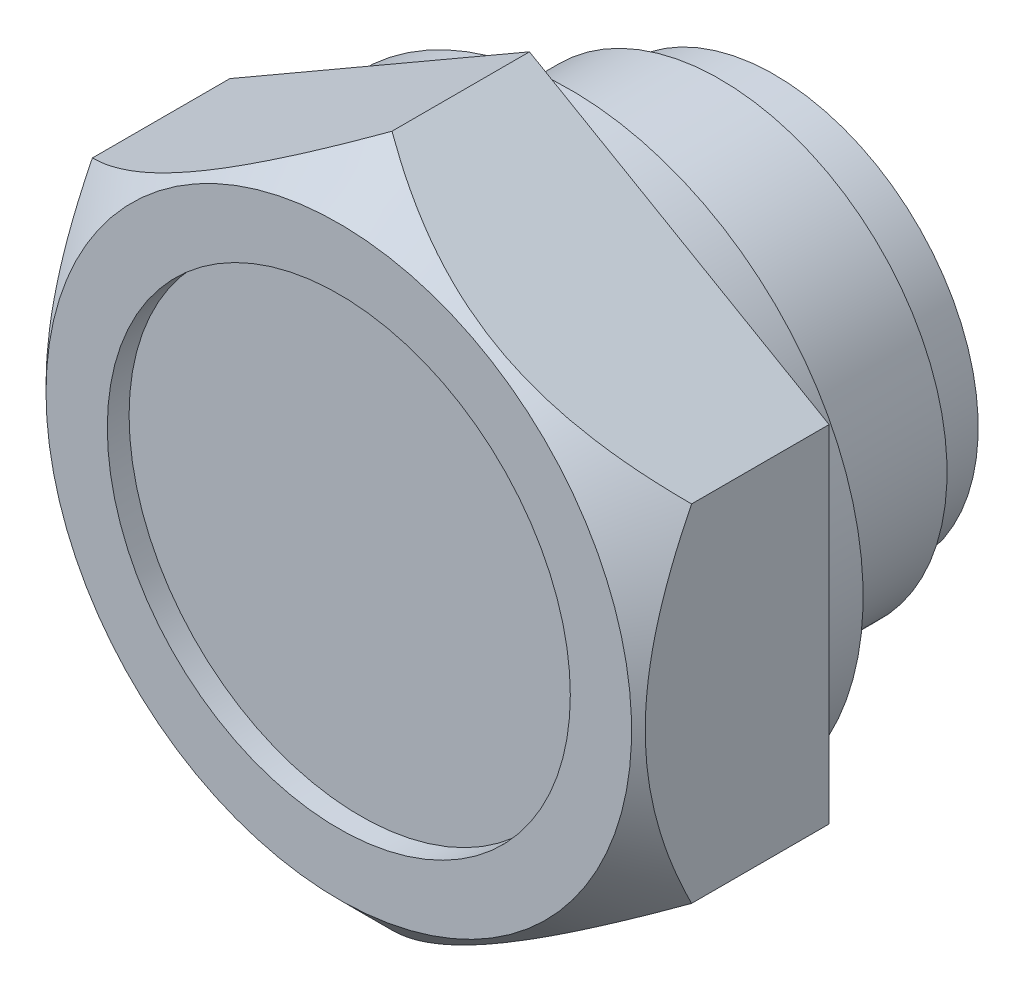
ISO-10303-21;
HEADER;
FILE_DESCRIPTION(('STEP AP214'),'2;1');
FILE_NAME('part.step','',(''),(''),'','','');
FILE_SCHEMA(('AUTOMOTIVE_DESIGN { 1 0 10303 214 1 1 1 1 }'));
ENDSEC;
DATA;
#1=APPLICATION_CONTEXT('core data for automotive mechanical design processes');
#2=APPLICATION_PROTOCOL_DEFINITION('international standard','automotive_design',2000,#1);
#3=PRODUCT_CONTEXT('',#1,'mechanical');
#4=PRODUCT('Part','Part','',(#3));
#5=PRODUCT_RELATED_PRODUCT_CATEGORY('part','',(#4));
#6=PRODUCT_DEFINITION_FORMATION('','',#4);
#7=PRODUCT_DEFINITION_CONTEXT('part definition',#1,'design');
#8=PRODUCT_DEFINITION('design','',#6,#7);
#9=PRODUCT_DEFINITION_SHAPE('','',#8);
#10=(LENGTH_UNIT() NAMED_UNIT(*) SI_UNIT(.MILLI.,.METRE.));
#11=(NAMED_UNIT(*) PLANE_ANGLE_UNIT() SI_UNIT($,.RADIAN.));
#12=(NAMED_UNIT(*) SI_UNIT($,.STERADIAN.) SOLID_ANGLE_UNIT());
#13=UNCERTAINTY_MEASURE_WITH_UNIT(LENGTH_MEASURE(1.E-05),#10,'distance_accuracy_value','');
#14=(GEOMETRIC_REPRESENTATION_CONTEXT(3) GLOBAL_UNCERTAINTY_ASSIGNED_CONTEXT((#13)) GLOBAL_UNIT_ASSIGNED_CONTEXT((#10,
#11,#12)) REPRESENTATION_CONTEXT('',''));
#15=CARTESIAN_POINT('',(0.,0.,0.));
#16=DIRECTION('',(0.,0.,1.));
#17=DIRECTION('',(1.,0.,0.));
#18=AXIS2_PLACEMENT_3D('',#15,#16,#17);
#19=CARTESIAN_POINT('',(0.,10.75,1.5));
#20=DIRECTION('',(0.,0.,-1.));
#21=DIRECTION('',(-1.,0.,0.));
#22=AXIS2_PLACEMENT_3D('',#19,#20,#21);
#23=PLANE('',#22);
#24=CARTESIAN_POINT('',(0.,0.,1.5));
#25=DIRECTION('',(0.,0.,-1.));
#26=DIRECTION('',(-1.,0.,0.));
#27=AXIS2_PLACEMENT_3D('',#24,#25,#26);
#28=CIRCLE('',#27,10.75);
#29=CARTESIAN_POINT('',(-10.75,0.,1.5));
#30=VERTEX_POINT('',#29);
#31=EDGE_CURVE('E127',#30,#30,#28,.T.);
#32=ORIENTED_EDGE('',*,*,#31,.F.);
#33=EDGE_LOOP('',(#32));
#34=FACE_BOUND('',#33,.T.);
#35=DIRECTION('',(-0.866025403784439,-0.5,0.));
#36=VECTOR('',#35,1.);
#37=CARTESIAN_POINT('',(-0.845113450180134,12.2137794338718,1.5));
#38=LINE('',#37,#36);
#39=CARTESIAN_POINT('',(-1.61363977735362E-11,12.7017059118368,1.5));
#40=VERTEX_POINT('',#39);
#41=CARTESIAN_POINT('',(-10.9999999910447,6.35085295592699,1.5));
#42=VERTEX_POINT('',#41);
#43=EDGE_CURVE('E110',#40,#42,#38,.T.);
#44=ORIENTED_EDGE('',*,*,#43,.F.);
#45=DIRECTION('',(-0.866025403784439,0.5,0.));
#46=VECTOR('',#45,1.);
#47=CARTESIAN_POINT('',(0.84511345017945,12.2137794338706,1.5));
#48=LINE('',#47,#46);
#49=CARTESIAN_POINT('',(10.9999999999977,6.35085294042,1.5));
#50=VERTEX_POINT('',#49);
#51=EDGE_CURVE('E107',#50,#40,#48,.T.);
#52=ORIENTED_EDGE('',*,*,#51,.F.);
#53=DIRECTION('',(7.05455251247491E-10,1.,0.));
#54=VECTOR('',#53,1.);
#55=CARTESIAN_POINT('',(11.0000000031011,10.74999999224,1.5));
#56=LINE('',#55,#54);
#57=CARTESIAN_POINT('',(10.9999999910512,-6.35085295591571,1.5));
#58=VERTEX_POINT('',#57);
#59=EDGE_CURVE('E40',#58,#50,#56,.T.);
#60=ORIENTED_EDGE('',*,*,#59,.F.);
#61=DIRECTION('',(0.866025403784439,0.5,0.));
#62=VECTOR('',#61,1.);
#63=CARTESIAN_POINT('',(10.1548865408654,-6.83877943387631,1.5));
#64=LINE('',#63,#62);
#65=CARTESIAN_POINT('',(5.77055764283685E-12,-12.7017059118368,1.5));
#66=VERTEX_POINT('',#65);
#67=EDGE_CURVE('E35',#66,#58,#64,.T.);
#68=ORIENTED_EDGE('',*,*,#67,.F.);
#69=DIRECTION('',(0.866025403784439,-0.5,0.));
#70=VECTOR('',#69,1.);
#71=CARTESIAN_POINT('',(-10.1548865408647,-6.83877943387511,1.5));
#72=LINE('',#71,#70);
#73=CARTESIAN_POINT('',(-10.9999999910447,-6.3508529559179,1.5));
#74=VERTEX_POINT('',#73);
#75=EDGE_CURVE('E68',#74,#66,#72,.T.);
#76=ORIENTED_EDGE('',*,*,#75,.F.);
#77=DIRECTION('',(0.,-1.,0.));
#78=VECTOR('',#77,1.);
#79=CARTESIAN_POINT('',(-10.9999999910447,10.75,1.5));
#80=LINE('',#79,#78);
#81=EDGE_CURVE('E70',#42,#74,#80,.T.);
#82=ORIENTED_EDGE('',*,*,#81,.F.);
#83=EDGE_LOOP('',(#44,#52,#60,#68,#76,#82));
#84=FACE_BOUND('',#83,.T.);
#85=ADVANCED_FACE('F14',(#34,#84),#23,.T.);
#86=CARTESIAN_POINT('',(0.,8.331,0.));
#87=DIRECTION('',(0.,0.,-1.));
#88=DIRECTION('',(-1.,0.,0.));
#89=AXIS2_PLACEMENT_3D('',#86,#87,#88);
#90=PLANE('',#89);
#91=CARTESIAN_POINT('',(0.,0.,0.));
#92=DIRECTION('',(0.,0.,-1.));
#93=DIRECTION('',(-1.,0.,0.));
#94=AXIS2_PLACEMENT_3D('',#91,#92,#93);
#95=CIRCLE('',#94,10.75);
#96=CARTESIAN_POINT('',(-10.75,0.,0.));
#97=VERTEX_POINT('',#96);
#98=EDGE_CURVE('E130',#97,#97,#95,.T.);
#99=ORIENTED_EDGE('',*,*,#98,.T.);
#100=EDGE_LOOP('',(#99));
#101=FACE_BOUND('',#100,.T.);
#102=CARTESIAN_POINT('',(0.,0.,0.));
#103=DIRECTION('',(0.,0.,-1.));
#104=DIRECTION('',(-1.,0.,0.));
#105=AXIS2_PLACEMENT_3D('',#102,#103,#104);
#106=CIRCLE('',#105,8.331);
#107=CARTESIAN_POINT('',(-8.331,0.,0.));
#108=VERTEX_POINT('',#107);
#109=EDGE_CURVE('E112',#108,#108,#106,.T.);
#110=ORIENTED_EDGE('',*,*,#109,.F.);
#111=EDGE_LOOP('',(#110));
#112=FACE_BOUND('',#111,.T.);
#113=ADVANCED_FACE('F16',(#101,#112),#90,.T.);
#114=CARTESIAN_POINT('',(0.,0.,-11.2427603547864));
#115=DIRECTION('',(0.,0.,-1.));
#116=DIRECTION('',(-1.,0.,0.));
#117=AXIS2_PLACEMENT_3D('',#114,#115,#116);
#118=CYLINDRICAL_SURFACE('',#117,10.75);
#119=ORIENTED_EDGE('',*,*,#31,.T.);
#120=EDGE_LOOP('',(#119));
#121=FACE_BOUND('',#120,.T.);
#122=ORIENTED_EDGE('',*,*,#98,.F.);
#123=EDGE_LOOP('',(#122));
#124=FACE_BOUND('',#123,.T.);
#125=ADVANCED_FACE('F201',(#121,#124),#118,.T.);
#126=CARTESIAN_POINT('',(0.,0.,-7.5));
#127=DIRECTION('',(0.,0.,-1.));
#128=DIRECTION('',(-1.,0.,0.));
#129=AXIS2_PLACEMENT_3D('',#126,#127,#128);
#130=PLANE('',#129);
#131=CARTESIAN_POINT('',(0.,0.,-7.5));
#132=DIRECTION('',(0.,0.,-1.));
#133=DIRECTION('',(-1.,0.,0.));
#134=AXIS2_PLACEMENT_3D('',#131,#132,#133);
#135=CIRCLE('',#134,7.475);
#136=CARTESIAN_POINT('',(-7.475,0.,-7.5));
#137=VERTEX_POINT('',#136);
#138=EDGE_CURVE('E121',#137,#137,#135,.T.);
#139=ORIENTED_EDGE('',*,*,#138,.T.);
#140=EDGE_LOOP('',(#139));
#141=FACE_BOUND('',#140,.T.);
#142=ADVANCED_FACE('F198',(#141),#130,.T.);
#143=CARTESIAN_POINT('',(0.,0.,-11.2427603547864));
#144=DIRECTION('',(0.,0.,-1.));
#145=DIRECTION('',(-1.,0.,0.));
#146=AXIS2_PLACEMENT_3D('',#143,#144,#145);
#147=CYLINDRICAL_SURFACE('',#146,7.475);
#148=ORIENTED_EDGE('',*,*,#138,.F.);
#149=EDGE_LOOP('',(#148));
#150=FACE_BOUND('',#149,.T.);
#151=CARTESIAN_POINT('',(0.,0.,-5.5));
#152=DIRECTION('',(0.,0.,-1.));
#153=DIRECTION('',(-1.,0.,0.));
#154=AXIS2_PLACEMENT_3D('',#151,#152,#153);
#155=CIRCLE('',#154,7.475);
#156=CARTESIAN_POINT('',(-7.475,0.,-5.5));
#157=VERTEX_POINT('',#156);
#158=EDGE_CURVE('E118',#157,#157,#155,.T.);
#159=ORIENTED_EDGE('',*,*,#158,.T.);
#160=EDGE_LOOP('',(#159));
#161=FACE_BOUND('',#160,.T.);
#162=ADVANCED_FACE('F195',(#150,#161),#147,.T.);
#163=CARTESIAN_POINT('',(0.,7.475,-5.5));
#164=DIRECTION('',(0.,0.,-1.));
#165=DIRECTION('',(-1.,0.,0.));
#166=AXIS2_PLACEMENT_3D('',#163,#164,#165);
#167=PLANE('',#166);
#168=CARTESIAN_POINT('',(0.,0.,-5.5));
#169=DIRECTION('',(0.,0.,-1.));
#170=DIRECTION('',(-1.,0.,0.));
#171=AXIS2_PLACEMENT_3D('',#168,#169,#170);
#172=CIRCLE('',#171,8.331);
#173=CARTESIAN_POINT('',(-8.331,0.,-5.5));
#174=VERTEX_POINT('',#173);
#175=EDGE_CURVE('E115',#174,#174,#172,.T.);
#176=ORIENTED_EDGE('',*,*,#175,.T.);
#177=EDGE_LOOP('',(#176));
#178=FACE_BOUND('',#177,.T.);
#179=ORIENTED_EDGE('',*,*,#158,.F.);
#180=EDGE_LOOP('',(#179));
#181=FACE_BOUND('',#180,.T.);
#182=ADVANCED_FACE('F191',(#178,#181),#167,.T.);
#183=CARTESIAN_POINT('',(0.,0.,-11.2427603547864));
#184=DIRECTION('',(0.,0.,-1.));
#185=DIRECTION('',(-1.,0.,0.));
#186=AXIS2_PLACEMENT_3D('',#183,#184,#185);
#187=CYLINDRICAL_SURFACE('',#186,8.331);
#188=ORIENTED_EDGE('',*,*,#175,.F.);
#189=EDGE_LOOP('',(#188));
#190=FACE_BOUND('',#189,.T.);
#191=ORIENTED_EDGE('',*,*,#109,.T.);
#192=EDGE_LOOP('',(#191));
#193=FACE_BOUND('',#192,.T.);
#194=ADVANCED_FACE('F188',(#190,#193),#187,.T.);
#195=CARTESIAN_POINT('',(-10.9999999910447,6.35085295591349,-7.5));
#196=DIRECTION('',(0.5,-0.866025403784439,0.));
#197=DIRECTION('',(-0.866025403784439,-0.5,0.));
#198=AXIS2_PLACEMENT_3D('',#195,#196,#197);
#199=PLANE('',#198);
#200=DIRECTION('',(0.,0.,1.));
#201=VECTOR('',#200,1.);
#202=CARTESIAN_POINT('',(-1.36696209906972E-12,12.7017059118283,-7.5));
#203=LINE('',#202,#201);
#204=CARTESIAN_POINT('',(-1.36696209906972E-12,12.7017059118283,6.5482940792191));
#205=VERTEX_POINT('',#204);
#206=EDGE_CURVE('E84',#40,#205,#203,.T.);
#207=ORIENTED_EDGE('',*,*,#206,.F.);
#208=ORIENTED_EDGE('',*,*,#43,.T.);
#209=DIRECTION('',(0.,0.,1.));
#210=VECTOR('',#209,1.);
#211=CARTESIAN_POINT('',(-10.9999999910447,6.35085295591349,-7.5));
#212=LINE('',#211,#210);
#213=CARTESIAN_POINT('',(-10.9999999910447,6.35085295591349,6.54829407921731));
#214=VERTEX_POINT('',#213);
#215=EDGE_CURVE('E83',#42,#214,#212,.T.);
#216=ORIENTED_EDGE('',*,*,#215,.T.);
#217=CARTESIAN_POINT('',(0.000199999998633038,12.7018213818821,6.5481786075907));
#218=CARTESIAN_POINT('',(-0.188914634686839,12.5926359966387,6.65734811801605));
#219=CARTESIAN_POINT('',(-0.379510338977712,12.48259551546,6.76318636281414));
#220=CARTESIAN_POINT('',(-0.763894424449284,12.2606712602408,6.96714214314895));
#221=CARTESIAN_POINT('',(-0.957684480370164,12.1487865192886,7.06525546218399));
#222=CARTESIAN_POINT('',(-1.34960183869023,11.9225129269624,7.25311872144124));
#223=CARTESIAN_POINT('',(-1.54774762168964,11.8081134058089,7.34281755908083));
#224=CARTESIAN_POINT('',(-1.94729364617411,11.5774354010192,7.51190368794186));
#225=CARTESIAN_POINT('',(-2.14869338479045,11.4611572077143,7.59129255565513));
#226=CARTESIAN_POINT('',(-2.55150915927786,11.2285914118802,7.73724688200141));
#227=CARTESIAN_POINT('',(-2.75287569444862,11.1123323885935,7.80399344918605));
#228=CARTESIAN_POINT('',(-3.15843154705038,10.8781846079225,7.9248319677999));
#229=CARTESIAN_POINT('',(-3.36262055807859,10.7602960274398,7.9789252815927));
#230=CARTESIAN_POINT('',(-3.77294799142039,10.523393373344,8.07309544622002));
#231=CARTESIAN_POINT('',(-3.9790809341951,10.4043824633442,8.1132038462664));
#232=CARTESIAN_POINT('',(-4.39307735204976,10.1653615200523,8.17852285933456));
#233=CARTESIAN_POINT('',(-4.60094056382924,10.0453516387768,8.20373569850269));
#234=CARTESIAN_POINT('',(-5.10748652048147,9.75289719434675,8.24601057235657));
#235=CARTESIAN_POINT('',(-5.406716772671,9.58013652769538,8.2548818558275));
#236=CARTESIAN_POINT('',(-6.00463608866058,9.23492764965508,8.23999113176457));
#237=CARTESIAN_POINT('',(-6.30332492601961,9.06247956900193,8.21621768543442));
#238=CARTESIAN_POINT('',(-6.89788699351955,8.7192089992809,8.13744074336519));
#239=CARTESIAN_POINT('',(-7.19375669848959,8.54838854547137,8.08240232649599));
#240=CARTESIAN_POINT('',(-7.78041067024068,8.20968371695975,7.94408715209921));
#241=CARTESIAN_POINT('',(-8.07119532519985,8.04179911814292,7.86081256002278));
#242=CARTESIAN_POINT('',(-8.58737457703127,7.74378288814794,7.68949668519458));
#243=CARTESIAN_POINT('',(-8.8139124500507,7.61299118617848,7.60596208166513));
#244=CARTESIAN_POINT('',(-9.26292184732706,7.35375548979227,7.4254323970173));
#245=CARTESIAN_POINT('',(-9.48539324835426,7.22531156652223,7.32843690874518));
#246=CARTESIAN_POINT('',(-9.92556897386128,6.97117599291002,7.12315952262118));
#247=CARTESIAN_POINT('',(-10.1432858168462,6.84547711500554,7.01491311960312));
#248=CARTESIAN_POINT('',(-10.5746882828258,6.5964067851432,6.78855485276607));
#249=CARTESIAN_POINT('',(-10.7883762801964,6.47303396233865,6.67044903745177));
#250=CARTESIAN_POINT('',(-11.0001999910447,6.3507374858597,6.5481786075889));
#251=B_SPLINE_CURVE_WITH_KNOTS('',3,(#217,#218,#219,#220,#221,#222,#223,#224,#225,#226,#227,
#228,#229,#230,#231,#232,#233,#234,#235,#236,#237,#238,#239,#240,#241,#242,#243,#244,#245,#246,
#247,#248,#249,#250),.UNSPECIFIED.,.F.,.F.,(4,2,2,2,2,2,2,2,2,2,2,2,2,2,2,2,4),(0.,
0.732447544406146,1.46529214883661,2.20233279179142,2.93926060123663,3.66466501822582,
4.3899912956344,5.11367052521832,5.83724157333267,6.87253110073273,7.90818348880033,
8.94499492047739,9.98172685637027,10.8051335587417,11.628565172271,12.4494736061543,
13.2698820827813),.UNSPECIFIED.);
#252=EDGE_CURVE('E9',#205,#214,#251,.T.);
#253=ORIENTED_EDGE('',*,*,#252,.F.);
#254=EDGE_LOOP('',(#207,#208,#216,#253));
#255=FACE_BOUND('',#254,.T.);
#256=ADVANCED_FACE('F185',(#255),#199,.F.);
#257=CARTESIAN_POINT('',(-1.36696209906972E-12,12.7017059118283,-7.5));
#258=DIRECTION('',(-0.5,-0.866025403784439,0.));
#259=DIRECTION('',(-0.866025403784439,0.5,0.));
#260=AXIS2_PLACEMENT_3D('',#257,#258,#259);
#261=PLANE('',#260);
#262=DIRECTION('',(0.,0.,1.));
#263=VECTOR('',#262,1.);
#264=CARTESIAN_POINT('',(10.9999999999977,6.35085295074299,-7.5));
#265=LINE('',#264,#263);
#266=CARTESIAN_POINT('',(10.9999999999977,6.35085295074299,6.54829407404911));
#267=VERTEX_POINT('',#266);
#268=EDGE_CURVE('E100',#50,#267,#265,.T.);
#269=ORIENTED_EDGE('',*,*,#268,.F.);
#270=ORIENTED_EDGE('',*,*,#51,.T.);
#271=ORIENTED_EDGE('',*,*,#206,.T.);
#272=CARTESIAN_POINT('',(11.0001999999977,6.3507374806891,6.5481786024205));
#273=CARTESIAN_POINT('',(10.811085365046,6.45992286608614,6.65734811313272));
#274=CARTESIAN_POINT('',(10.6204896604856,6.56996334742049,6.76318635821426));
#275=CARTESIAN_POINT('',(10.2361055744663,6.79188760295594,6.96714213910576));
#276=CARTESIAN_POINT('',(10.0423155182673,6.90377234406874,7.06525545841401));
#277=CARTESIAN_POINT('',(9.65039815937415,7.13004593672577,7.25311871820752));
#278=CARTESIAN_POINT('',(9.45225237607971,7.24444545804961,7.34281755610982));
#279=CARTESIAN_POINT('',(9.05270635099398,7.47512346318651,7.51190368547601));
#280=CARTESIAN_POINT('',(8.85130661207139,7.59140165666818,7.59129255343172));
#281=CARTESIAN_POINT('',(8.44849083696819,7.82396745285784,7.73724688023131));
#282=CARTESIAN_POINT('',(8.24712430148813,7.94022647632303,7.80399344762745));
#283=CARTESIAN_POINT('',(7.84156844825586,8.17437425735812,7.92483196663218));
#284=CARTESIAN_POINT('',(7.63737943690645,8.29226283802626,7.97892528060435));
#285=CARTESIAN_POINT('',(7.22705200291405,8.52916549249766,8.07309544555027));
#286=CARTESIAN_POINT('',(7.02091905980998,8.64817640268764,8.11320384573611));
#287=CARTESIAN_POINT('',(6.60692264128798,8.88719734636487,8.17852285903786));
#288=CARTESIAN_POINT('',(6.39905942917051,9.00720722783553,8.20373569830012));
#289=CARTESIAN_POINT('',(5.89251347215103,9.29966167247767,8.2460105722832));
#290=CARTESIAN_POINT('',(5.59328321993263,9.4724223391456,8.25488185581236));
#291=CARTESIAN_POINT('',(4.99536390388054,9.81763121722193,8.23999113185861));
#292=CARTESIAN_POINT('',(4.69667506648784,9.99007929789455,8.21621768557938));
#293=CARTESIAN_POINT('',(4.10211299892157,10.3333498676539,8.13744074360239));
#294=CARTESIAN_POINT('',(3.80624329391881,10.5041703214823,8.08240232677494));
#295=CARTESIAN_POINT('',(3.21958932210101,10.8428751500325,7.94408715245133));
#296=CARTESIAN_POINT('',(2.92880466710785,11.010759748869,7.86081256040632));
#297=CARTESIAN_POINT('',(2.41262541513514,11.3087759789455,7.68949668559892));
#298=CARTESIAN_POINT('',(2.18608754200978,11.4395676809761,7.60596208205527));
#299=CARTESIAN_POINT('',(1.73707814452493,11.6988033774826,7.42543239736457));
#300=CARTESIAN_POINT('',(1.51460674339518,11.8272473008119,7.32843690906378));
#301=CARTESIAN_POINT('',(1.07443101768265,12.0813828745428,7.1231595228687));
#302=CARTESIAN_POINT('',(0.856714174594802,12.2070817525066,7.01491311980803));
#303=CARTESIAN_POINT('',(0.425311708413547,12.4561520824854,6.7885548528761));
#304=CARTESIAN_POINT('',(0.211623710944,12.5795249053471,6.67044903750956));
#305=CARTESIAN_POINT('',(-0.000200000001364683,12.7018213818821,6.5481786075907));
#306=B_SPLINE_CURVE_WITH_KNOTS('',3,(#272,#273,#274,#275,#276,#277,#278,#279,#280,#281,#282,
#283,#284,#285,#286,#287,#288,#289,#290,#291,#292,#293,#294,#295,#296,#297,#298,#299,#300,#301,
#302,#303,#304,#305),.UNSPECIFIED.,.F.,.F.,(4,2,2,2,2,2,2,2,2,2,2,2,2,2,2,2,4),(0.,
0.732447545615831,1.46529215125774,2.20233279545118,2.93926060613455,3.66466502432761,
4.38999130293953,5.1136705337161,5.83724158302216,6.87253111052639,7.90818349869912,
8.94499493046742,9.98172686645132,10.8051335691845,11.628565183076,12.4494736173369,
13.2698820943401),.UNSPECIFIED.);
#307=EDGE_CURVE('E28',#267,#205,#306,.T.);
#308=ORIENTED_EDGE('',*,*,#307,.F.);
#309=EDGE_LOOP('',(#269,#270,#271,#308));
#310=FACE_BOUND('',#309,.T.);
#311=ADVANCED_FACE('F180',(#310),#261,.F.);
#312=CARTESIAN_POINT('',(10.9999999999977,6.35085295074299,-7.5));
#313=DIRECTION('',(-1.,7.05455251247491E-10,0.));
#314=DIRECTION('',(7.05455251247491E-10,1.,0.));
#315=AXIS2_PLACEMENT_3D('',#312,#313,#314);
#316=PLANE('',#315);
#317=DIRECTION('',(0.,0.,1.));
#318=VECTOR('',#317,1.);
#319=CARTESIAN_POINT('',(10.9999999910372,-6.3508529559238,-7.5));
#320=LINE('',#319,#318);
#321=CARTESIAN_POINT('',(10.9999999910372,-6.3508529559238,6.54829407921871));
#322=VERTEX_POINT('',#321);
#323=EDGE_CURVE('E92',#58,#322,#320,.T.);
#324=ORIENTED_EDGE('',*,*,#323,.F.);
#325=ORIENTED_EDGE('',*,*,#59,.T.);
#326=ORIENTED_EDGE('',*,*,#268,.T.);
#327=CARTESIAN_POINT('',(10.9999999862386,-13.1530028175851,2.1035285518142));
#328=CARTESIAN_POINT('',(10.999999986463,-12.8348404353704,2.34753495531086));
#329=CARTESIAN_POINT('',(10.9999999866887,-12.5149523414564,2.58932675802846));
#330=CARTESIAN_POINT('',(10.9999999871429,-11.8710234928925,3.06747277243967));
#331=CARTESIAN_POINT('',(10.9999999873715,-11.546981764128,3.30382567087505));
#332=CARTESIAN_POINT('',(10.9999999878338,-10.8916753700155,3.77176769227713));
#333=CARTESIAN_POINT('',(10.9999999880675,-10.5603742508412,4.00330593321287));
#334=CARTESIAN_POINT('',(10.9999999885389,-9.8922387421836,4.45822908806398));
#335=CARTESIAN_POINT('',(10.9999999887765,-9.55540473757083,4.68161456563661));
#336=CARTESIAN_POINT('',(10.9999999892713,-8.85408498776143,5.13199419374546));
#337=CARTESIAN_POINT('',(10.9999999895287,-8.48918429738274,5.35834545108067));
#338=CARTESIAN_POINT('',(10.9999999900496,-7.75082072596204,5.79686046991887));
#339=CARTESIAN_POINT('',(10.999999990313,-7.37735643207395,6.00902186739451));
#340=CARTESIAN_POINT('',(10.999999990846,-6.6217866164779,6.41462859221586));
#341=CARTESIAN_POINT('',(10.9999999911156,-6.23971083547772,6.60812888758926));
#342=CARTESIAN_POINT('',(10.9999999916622,-5.46482097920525,6.97207847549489));
#343=CARTESIAN_POINT('',(10.9999999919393,-5.07201204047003,7.14253856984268));
#344=CARTESIAN_POINT('',(10.9999999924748,-4.31299594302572,7.43932768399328));
#345=CARTESIAN_POINT('',(10.9999999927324,-3.9478404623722,7.56831887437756));
#346=CARTESIAN_POINT('',(10.9999999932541,-3.20831241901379,7.79706368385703));
#347=CARTESIAN_POINT('',(10.9999999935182,-2.83393926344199,7.89681541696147));
#348=CARTESIAN_POINT('',(10.9999999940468,-2.08468080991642,8.0600532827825));
#349=CARTESIAN_POINT('',(10.9999999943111,-1.7099400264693,8.12419164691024));
#350=CARTESIAN_POINT('',(10.9999999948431,-0.955912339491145,8.21487946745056));
#351=CARTESIAN_POINT('',(10.9999999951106,-0.576626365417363,8.24143648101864));
#352=CARTESIAN_POINT('',(10.9999999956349,0.166570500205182,8.25474812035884));
#353=CARTESIAN_POINT('',(10.9999999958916,0.530452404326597,8.2431404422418));
#354=CARTESIAN_POINT('',(10.999999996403,1.25533124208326,8.18450074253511));
#355=CARTESIAN_POINT('',(10.9999999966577,1.61632790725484,8.13746546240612));
#356=CARTESIAN_POINT('',(10.9999999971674,2.33893839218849,8.00981463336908));
#357=CARTESIAN_POINT('',(10.9999999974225,2.70044637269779,7.92860991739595));
#358=CARTESIAN_POINT('',(10.9999999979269,3.41551710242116,7.73709548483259));
#359=CARTESIAN_POINT('',(10.9999999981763,3.76908033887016,7.62678755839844));
#360=CARTESIAN_POINT('',(10.9999999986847,4.48973486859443,7.3741148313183));
#361=CARTESIAN_POINT('',(10.9999999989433,4.85626279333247,7.23016108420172));
#362=CARTESIAN_POINT('',(10.9999999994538,5.57987775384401,6.92003336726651));
#363=CARTESIAN_POINT('',(10.9999999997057,5.93696042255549,6.75384932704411));
#364=CARTESIAN_POINT('',(11.000000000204,6.64337989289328,6.40320367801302));
#365=CARTESIAN_POINT('',(11.0000000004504,6.99268843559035,6.21868559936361));
#366=CARTESIAN_POINT('',(11.0000000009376,7.68329635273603,5.83543512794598));
#367=CARTESIAN_POINT('',(11.0000000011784,8.02459695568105,5.63670493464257));
#368=CARTESIAN_POINT('',(11.0000000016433,8.68354150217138,5.23791339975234));
#369=CARTESIAN_POINT('',(11.0000000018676,9.00152089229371,5.03840340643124));
#370=CARTESIAN_POINT('',(11.0000000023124,9.63201705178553,4.63090569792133));
#371=CARTESIAN_POINT('',(11.0000000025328,9.94453340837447,4.42291734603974));
#372=CARTESIAN_POINT('',(11.0000000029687,10.5623022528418,4.00167229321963));
#373=CARTESIAN_POINT('',(11.000000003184,10.8675929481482,3.78847142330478));
#374=CARTESIAN_POINT('',(11.0000000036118,11.473988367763,3.35636541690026));
#375=CARTESIAN_POINT('',(11.0000000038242,11.7750942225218,3.13746186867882));
#376=CARTESIAN_POINT('',(11.0000000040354,12.074445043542,2.91622445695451));
#377=B_SPLINE_CURVE_WITH_KNOTS('',3,(#327,#328,#329,#330,#331,#332,#333,#334,#335,#336,#337,
#338,#339,#340,#341,#342,#343,#344,#345,#346,#347,#348,#349,#350,#351,#352,#353,#354,#355,#356,
#357,#358,#359,#360,#361,#362,#363,#364,#365,#366,#367,#368,#369,#370,#371,#372,#373,#374,#375,
#376),.UNSPECIFIED.,.F.,.F.,(4,2,2,2,2,2,2,2,2,2,2,2,2,2,2,2,2,2,2,2,2,2,2,2,4),(0.,
1.20289302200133,2.40607350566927,3.61854532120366,4.83093315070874,6.11888725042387,
7.4070553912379,8.69130514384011,9.97495070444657,11.135753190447,12.2966305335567,
13.4354799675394,14.5741003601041,15.6645094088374,16.7550187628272,17.8651559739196,
18.9752249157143,20.1556679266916,21.3366475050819,22.5213844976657,23.7059385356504,
24.831940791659,25.9580277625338,27.0750572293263,28.1917788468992),.UNSPECIFIED.);
#378=EDGE_CURVE('E168',#322,#267,#377,.T.);
#379=ORIENTED_EDGE('',*,*,#378,.F.);
#380=EDGE_LOOP('',(#324,#325,#326,#379));
#381=FACE_BOUND('',#380,.T.);
#382=ADVANCED_FACE('F184',(#381),#316,.F.);
#383=CARTESIAN_POINT('',(10.9999999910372,-6.3508529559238,-7.5));
#384=DIRECTION('',(-0.5,0.866025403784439,0.));
#385=DIRECTION('',(0.866025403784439,0.5,0.));
#386=AXIS2_PLACEMENT_3D('',#383,#384,#385);
#387=PLANE('',#386);
#388=DIRECTION('',(0.,0.,1.));
#389=VECTOR('',#388,1.);
#390=CARTESIAN_POINT('',(1.346145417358E-12,-12.7017059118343,-7.5));
#391=LINE('',#390,#389);
#392=CARTESIAN_POINT('',(1.346145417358E-12,-12.7017059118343,6.5482940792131));
#393=VERTEX_POINT('',#392);
#394=EDGE_CURVE('E90',#66,#393,#391,.T.);
#395=ORIENTED_EDGE('',*,*,#394,.F.);
#396=ORIENTED_EDGE('',*,*,#67,.T.);
#397=ORIENTED_EDGE('',*,*,#323,.T.);
#398=CARTESIAN_POINT('',(-0.000199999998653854,-12.7018213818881,6.54817860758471));
#399=CARTESIAN_POINT('',(0.188914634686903,-12.5926359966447,6.65734811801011));
#400=CARTESIAN_POINT('',(0.379510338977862,-12.4825955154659,6.76318636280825));
#401=CARTESIAN_POINT('',(0.763894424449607,-12.2606712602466,6.96714214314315));
#402=CARTESIAN_POINT('',(0.957684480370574,-12.1487865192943,7.06525546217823));
#403=CARTESIAN_POINT('',(1.34960183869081,-11.9225129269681,7.25311872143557));
#404=CARTESIAN_POINT('',(1.54774762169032,-11.8081134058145,7.3428175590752));
#405=CARTESIAN_POINT('',(1.94729364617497,-11.5774354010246,7.51190368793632));
#406=CARTESIAN_POINT('',(2.14869338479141,-11.4611572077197,7.59129255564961));
#407=CARTESIAN_POINT('',(2.551509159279,-11.2285914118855,7.73724688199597));
#408=CARTESIAN_POINT('',(2.75287569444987,-11.1123323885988,7.80399344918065));
#409=CARTESIAN_POINT('',(3.15843154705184,-10.8781846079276,7.92483196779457));
#410=CARTESIAN_POINT('',(3.36262055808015,-10.7602960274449,7.97892528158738));
#411=CARTESIAN_POINT('',(3.77294799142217,-10.523393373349,8.07309544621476));
#412=CARTESIAN_POINT('',(3.97908093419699,-10.4043824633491,8.11320384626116));
#413=CARTESIAN_POINT('',(4.39307735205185,-10.165361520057,8.17852285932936));
#414=CARTESIAN_POINT('',(4.60094056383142,-10.0453516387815,8.20373569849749));
#415=CARTESIAN_POINT('',(5.10748652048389,-9.75289719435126,8.24601057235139));
#416=CARTESIAN_POINT('',(5.40671677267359,-9.58013652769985,8.25488185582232));
#417=CARTESIAN_POINT('',(6.00463608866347,-9.23492764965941,8.23999113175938));
#418=CARTESIAN_POINT('',(6.30332492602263,-9.06247956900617,8.21621768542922));
#419=CARTESIAN_POINT('',(6.89788699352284,-8.71920899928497,8.13744074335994));
#420=CARTESIAN_POINT('',(7.19375669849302,-8.54838854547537,8.08240232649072));
#421=CARTESIAN_POINT('',(7.78041067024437,-8.2096837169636,7.94408715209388));
#422=CARTESIAN_POINT('',(8.07119532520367,-8.0417991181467,7.86081256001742));
#423=CARTESIAN_POINT('',(8.58737457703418,-7.74378288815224,7.68949668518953));
#424=CARTESIAN_POINT('',(8.8139124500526,-7.61299118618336,7.60596208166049));
#425=CARTESIAN_POINT('',(9.26292184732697,-7.3537554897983,7.4254323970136));
#426=CARTESIAN_POINT('',(9.48539324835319,-7.22531156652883,7.32843690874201));
#427=CARTESIAN_POINT('',(9.92556897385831,-6.97117599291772,7.12315952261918));
#428=CARTESIAN_POINT('',(10.1432858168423,-6.84547711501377,7.01491311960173));
#429=CARTESIAN_POINT('',(10.57468828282,-6.59640678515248,6.78855485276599));
#430=CARTESIAN_POINT('',(10.7883762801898,-6.47303396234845,6.67044903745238));
#431=CARTESIAN_POINT('',(11.0001999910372,-6.35073748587,6.5481786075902));
#432=B_SPLINE_CURVE_WITH_KNOTS('',3,(#398,#399,#400,#401,#402,#403,#404,#405,#406,#407,#408,
#409,#410,#411,#412,#413,#414,#415,#416,#417,#418,#419,#420,#421,#422,#423,#424,#425,#426,#427,
#428,#429,#430,#431),.UNSPECIFIED.,.F.,.F.,(4,2,2,2,2,2,2,2,2,2,2,2,2,2,2,2,4),(0.,
0.732447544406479,1.46529214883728,2.20233279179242,2.93926060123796,3.66466501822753,
4.38999129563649,5.11367052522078,5.83724157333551,6.87253110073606,7.90818348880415,
8.94499492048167,9.981726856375,10.8051335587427,11.6285651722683,12.4494736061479,
13.2698820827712),.UNSPECIFIED.);
#433=EDGE_CURVE('E161',#393,#322,#432,.T.);
#434=ORIENTED_EDGE('',*,*,#433,.F.);
#435=EDGE_LOOP('',(#395,#396,#397,#434));
#436=FACE_BOUND('',#435,.T.);
#437=ADVANCED_FACE('F320',(#436),#387,.F.);
#438=CARTESIAN_POINT('',(1.346145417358E-12,-12.7017059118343,-7.5));
#439=DIRECTION('',(0.5,0.866025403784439,0.));
#440=DIRECTION('',(0.866025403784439,-0.5,0.));
#441=AXIS2_PLACEMENT_3D('',#438,#439,#440);
#442=PLANE('',#441);
#443=DIRECTION('',(0.,0.,1.));
#444=VECTOR('',#443,1.);
#445=CARTESIAN_POINT('',(-10.9999999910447,-6.3508529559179,-7.5));
#446=LINE('',#445,#444);
#447=CARTESIAN_POINT('',(-10.9999999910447,-6.350852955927,6.54829407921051));
#448=VERTEX_POINT('',#447);
#449=EDGE_CURVE('E80',#74,#448,#446,.T.);
#450=ORIENTED_EDGE('',*,*,#449,.F.);
#451=ORIENTED_EDGE('',*,*,#75,.T.);
#452=ORIENTED_EDGE('',*,*,#394,.T.);
#453=CARTESIAN_POINT('',(-11.0001999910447,-6.3507374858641,6.54817860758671));
#454=CARTESIAN_POINT('',(-10.8110853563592,-6.45992287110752,6.65734811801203));
#455=CARTESIAN_POINT('',(-10.6204896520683,-6.56996335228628,6.76318636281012));
#456=CARTESIAN_POINT('',(-10.2361055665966,-6.79188760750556,6.96714214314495));
#457=CARTESIAN_POINT('',(-10.0423155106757,-6.90377234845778,7.06525546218));
#458=CARTESIAN_POINT('',(-9.6503981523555,-7.13004594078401,7.25311872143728));
#459=CARTESIAN_POINT('',(-9.45225236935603,-7.24444546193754,7.34281755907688));
#460=CARTESIAN_POINT('',(-9.05270634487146,-7.47512346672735,7.51190368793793));
#461=CARTESIAN_POINT('',(-8.85130660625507,-7.59140166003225,7.59129255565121));
#462=CARTESIAN_POINT('',(-8.44849083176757,-7.82396745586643,7.7372468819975));
#463=CARTESIAN_POINT('',(-8.24712429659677,-7.94022647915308,7.80399344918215));
#464=CARTESIAN_POINT('',(-7.84156844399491,-8.17437425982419,7.92483196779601));
#465=CARTESIAN_POINT('',(-7.63737943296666,-8.29226284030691,7.97892528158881));
#466=CARTESIAN_POINT('',(-7.22705199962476,-8.52916549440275,8.07309544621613));
#467=CARTESIAN_POINT('',(-7.02091905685,-8.64817640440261,8.11320384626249));
#468=CARTESIAN_POINT('',(-6.60692263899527,-8.88719734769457,8.1785228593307));
#469=CARTESIAN_POINT('',(-6.39905942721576,-9.00720722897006,8.20373569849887));
#470=CARTESIAN_POINT('',(-5.8925134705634,-9.29966167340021,8.24601057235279));
#471=CARTESIAN_POINT('',(-5.59328321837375,-9.47242234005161,8.25488185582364));
#472=CARTESIAN_POINT('',(-4.99536390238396,-9.81763121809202,8.23999113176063));
#473=CARTESIAN_POINT('',(-4.69667506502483,-9.99007929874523,8.21621768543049));
#474=CARTESIAN_POINT('',(-4.10211299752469,-10.3333498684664,8.13744074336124));
#475=CARTESIAN_POINT('',(-3.80624329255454,-10.504170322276,8.08240232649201));
#476=CARTESIAN_POINT('',(-3.21958932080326,-10.8428751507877,7.94408715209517));
#477=CARTESIAN_POINT('',(-2.92880466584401,-11.0107597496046,7.8608125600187));
#478=CARTESIAN_POINT('',(-2.41262541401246,-11.3087759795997,7.68949668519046));
#479=CARTESIAN_POINT('',(-2.18608754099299,-11.4395676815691,7.605962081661));
#480=CARTESIAN_POINT('',(-1.73707814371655,-11.6988033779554,7.42543239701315));
#481=CARTESIAN_POINT('',(-1.51460674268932,-11.8272473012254,7.32843690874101));
#482=CARTESIAN_POINT('',(-1.07443101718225,-12.0813828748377,7.12315952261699));
#483=CARTESIAN_POINT('',(-0.856714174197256,-12.2070817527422,7.01491311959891));
#484=CARTESIAN_POINT('',(-0.425311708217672,-12.4561520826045,6.78855485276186));
#485=CARTESIAN_POINT('',(-0.211623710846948,-12.5795249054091,6.67044903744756));
#486=CARTESIAN_POINT('',(0.00020000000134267,-12.7018213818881,6.54817860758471));
#487=B_SPLINE_CURVE_WITH_KNOTS('',3,(#453,#454,#455,#456,#457,#458,#459,#460,#461,#462,#463,
#464,#465,#466,#467,#468,#469,#470,#471,#472,#473,#474,#475,#476,#477,#478,#479,#480,#481,#482,
#483,#484,#485,#486),.UNSPECIFIED.,.F.,.F.,(4,2,2,2,2,2,2,2,2,2,2,2,2,2,2,2,4),(0.,
0.732447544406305,1.46529214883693,2.20233279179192,2.9392606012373,3.66466501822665,
4.38999129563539,5.11367052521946,5.83724157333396,6.87253110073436,7.90818348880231,
8.94499492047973,9.98172685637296,10.8051335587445,11.6285651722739,12.4494736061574,
13.2698820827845),.UNSPECIFIED.);
#488=EDGE_CURVE('E88',#448,#393,#487,.T.);
#489=ORIENTED_EDGE('',*,*,#488,.F.);
#490=EDGE_LOOP('',(#450,#451,#452,#489));
#491=FACE_BOUND('',#490,.T.);
#492=ADVANCED_FACE('F86',(#491),#442,.F.);
#493=CARTESIAN_POINT('',(-10.9999999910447,-6.3508529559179,-7.5));
#494=DIRECTION('',(1.,0.,0.));
#495=DIRECTION('',(0.,0.,-1.));
#496=AXIS2_PLACEMENT_3D('',#493,#494,#495);
#497=PLANE('',#496);
#498=ORIENTED_EDGE('',*,*,#215,.F.);
#499=ORIENTED_EDGE('',*,*,#81,.T.);
#500=ORIENTED_EDGE('',*,*,#449,.T.);
#501=CARTESIAN_POINT('',(-10.9999999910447,-13.1530028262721,2.1035285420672));
#502=CARTESIAN_POINT('',(-10.9999999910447,-12.8348404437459,2.34753494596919));
#503=CARTESIAN_POINT('',(-10.9999999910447,-12.5149523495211,2.58932674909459));
#504=CARTESIAN_POINT('',(-10.9999999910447,-11.8710235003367,3.06747276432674));
#505=CARTESIAN_POINT('',(-10.9999999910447,-11.5469817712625,3.30382566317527));
#506=CARTESIAN_POINT('',(-10.9999999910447,-10.8916753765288,3.77176768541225));
#507=CARTESIAN_POINT('',(-10.9999999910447,-10.5603742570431,4.00330592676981));
#508=CARTESIAN_POINT('',(-10.9999999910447,-9.89223874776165,4.45822908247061));
#509=CARTESIAN_POINT('',(-10.9999999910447,-9.55540474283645,4.68161456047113));
#510=CARTESIAN_POINT('',(-10.9999999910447,-8.85408499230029,5.13199418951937));
#511=CARTESIAN_POINT('',(-10.9999999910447,-8.48918430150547,5.35834544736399));
#512=CARTESIAN_POINT('',(-10.9999999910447,-7.75082072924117,5.79686046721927));
#513=CARTESIAN_POINT('',(-10.9999999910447,-7.3773564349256,6.00902186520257));
#514=CARTESIAN_POINT('',(-10.9999999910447,-6.62178661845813,6.4146285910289));
#515=CARTESIAN_POINT('',(-10.9999999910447,-6.23971083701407,6.60812888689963));
#516=CARTESIAN_POINT('',(-10.9999999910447,-5.46482097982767,6.97207847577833));
#517=CARTESIAN_POINT('',(-10.9999999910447,-5.07201204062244,7.14253857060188));
#518=CARTESIAN_POINT('',(-10.9999999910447,-4.31299594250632,7.43932768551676));
#519=CARTESIAN_POINT('',(-10.9999999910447,-3.94784046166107,7.56831887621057));
#520=CARTESIAN_POINT('',(-10.9999999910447,-3.20831241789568,7.79706368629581));
#521=CARTESIAN_POINT('',(-10.9999999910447,-2.83393926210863,7.89681541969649));
#522=CARTESIAN_POINT('',(-10.9999999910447,-2.0846808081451,8.06005328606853));
#523=CARTESIAN_POINT('',(-10.9999999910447,-1.70994002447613,8.12419165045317));
#524=CARTESIAN_POINT('',(-10.9999999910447,-0.955912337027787,8.21487947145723));
#525=CARTESIAN_POINT('',(-10.9999999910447,-0.576626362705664,8.2414364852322));
#526=CARTESIAN_POINT('',(-10.9999999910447,0.166570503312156,8.2547481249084));
#527=CARTESIAN_POINT('',(-10.9999999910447,0.530452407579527,8.24314044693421));
#528=CARTESIAN_POINT('',(-10.9999999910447,1.25533124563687,8.18450074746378));
#529=CARTESIAN_POINT('',(-10.9999999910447,1.61632791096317,8.13746546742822));
#530=CARTESIAN_POINT('',(-10.9999999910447,2.33893839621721,8.00981463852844));
#531=CARTESIAN_POINT('',(-10.9999999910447,2.70044637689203,7.92860992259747));
#532=CARTESIAN_POINT('',(-10.9999999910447,3.41551710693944,7.73709549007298));
#533=CARTESIAN_POINT('',(-10.9999999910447,3.76908034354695,7.62678756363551));
#534=CARTESIAN_POINT('',(-10.9999999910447,4.48973487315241,7.37411483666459));
#535=CARTESIAN_POINT('',(-10.9999999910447,4.85626279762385,7.23016108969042));
#536=CARTESIAN_POINT('',(-10.9999999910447,5.57987775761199,6.92003337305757));
#537=CARTESIAN_POINT('',(-10.9999999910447,5.93696042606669,6.75384933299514));
#538=CARTESIAN_POINT('',(-10.9999999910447,6.64337989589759,6.40320368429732));
#539=CARTESIAN_POINT('',(-10.9999999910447,6.99268843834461,6.21868560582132));
#540=CARTESIAN_POINT('',(-10.9999999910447,7.68329635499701,5.83543513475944));
#541=CARTESIAN_POINT('',(-10.9999999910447,8.02459695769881,5.63670494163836));
#542=CARTESIAN_POINT('',(-10.9999999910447,8.68354150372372,5.23791340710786));
#543=CARTESIAN_POINT('',(-10.9999999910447,9.0015208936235,5.03840341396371));
#544=CARTESIAN_POINT('',(-10.9999999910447,9.63201705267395,4.63090570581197));
#545=CARTESIAN_POINT('',(-10.9999999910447,9.94453340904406,4.4229173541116));
#546=CARTESIAN_POINT('',(-10.9999999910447,10.5623022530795,4.00167230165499));
#547=CARTESIAN_POINT('',(-10.9999999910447,10.8675929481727,3.78847143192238));
#548=CARTESIAN_POINT('',(-10.9999999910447,11.4739883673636,3.35636542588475));
#549=CARTESIAN_POINT('',(-10.9999999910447,11.7750942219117,3.13746187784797));
#550=CARTESIAN_POINT('',(-10.9999999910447,12.0744450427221,2.91622446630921));
#551=B_SPLINE_CURVE_WITH_KNOTS('',3,(#501,#502,#503,#504,#505,#506,#507,#508,#509,#510,#511,
#512,#513,#514,#515,#516,#517,#518,#519,#520,#521,#522,#523,#524,#525,#526,#527,#528,#529,#530,
#531,#532,#533,#534,#535,#536,#537,#538,#539,#540,#541,#542,#543,#544,#545,#546,#547,#548,#549,
#550),.UNSPECIFIED.,.F.,.F.,(4,2,2,2,2,2,2,2,2,2,2,2,2,2,2,2,2,2,2,2,2,2,2,2,4),(0.,
1.20289302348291,2.40607350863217,3.61854532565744,4.83093315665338,6.11888725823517,
7.40705540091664,8.69130515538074,9.97495071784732,11.1357532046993,12.2966305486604,
13.4354799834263,14.5741003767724,15.6645094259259,16.7550187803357,17.8651559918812,
18.97522493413,20.1556679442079,21.3366475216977,22.5213845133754,23.7059385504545,
24.8319408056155,25.9580277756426,27.0750572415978,28.1917788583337),.UNSPECIFIED.);
#552=EDGE_CURVE('E133',#214,#448,#551,.F.);
#553=ORIENTED_EDGE('',*,*,#552,.F.);
#554=EDGE_LOOP('',(#498,#499,#500,#553));
#555=FACE_BOUND('',#554,.T.);
#556=ADVANCED_FACE('F79',(#555),#497,.F.);
#557=CARTESIAN_POINT('',(0.,0.,8.5));
#558=DIRECTION('',(0.,0.,-1.));
#559=DIRECTION('',(-1.,0.,0.));
#560=AXIS2_PLACEMENT_3D('',#557,#558,#559);
#561=PLANE('',#560);
#562=CARTESIAN_POINT('',(0.,0.,8.5));
#563=DIRECTION('',(0.,0.,1.));
#564=DIRECTION('',(1.,0.,0.));
#565=AXIS2_PLACEMENT_3D('',#562,#563,#564);
#566=CIRCLE('',#565,8.5);
#567=CARTESIAN_POINT('',(8.5,0.,8.5));
#568=VERTEX_POINT('',#567);
#569=EDGE_CURVE('E355',#568,#568,#566,.T.);
#570=ORIENTED_EDGE('',*,*,#569,.F.);
#571=EDGE_LOOP('',(#570));
#572=FACE_BOUND('',#571,.T.);
#573=CARTESIAN_POINT('',(0.,0.,8.5));
#574=DIRECTION('',(0.,0.,-1.));
#575=DIRECTION('',(-1.,0.,0.));
#576=AXIS2_PLACEMENT_3D('',#573,#574,#575);
#577=CIRCLE('',#576,10.7499999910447);
#578=CARTESIAN_POINT('',(-10.7499999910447,0.,8.5));
#579=VERTEX_POINT('',#578);
#580=EDGE_CURVE('E124',#579,#579,#577,.T.);
#581=ORIENTED_EDGE('',*,*,#580,.F.);
#582=EDGE_LOOP('',(#581));
#583=FACE_BOUND('',#582,.T.);
#584=ADVANCED_FACE('F153',(#572,#583),#561,.F.);
#585=CARTESIAN_POINT('',(0.,0.,8.5));
#586=DIRECTION('',(0.,0.,-1.));
#587=DIRECTION('',(-1.,0.,0.));
#588=AXIS2_PLACEMENT_3D('',#585,#586,#587);
#589=CONICAL_SURFACE('',#588,10.7499999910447,0.785398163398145);
#590=ORIENTED_EDGE('',*,*,#580,.T.);
#591=EDGE_LOOP('',(#590));
#592=FACE_BOUND('',#591,.T.);
#593=ORIENTED_EDGE('',*,*,#307,.T.);
#594=ORIENTED_EDGE('',*,*,#252,.T.);
#595=ORIENTED_EDGE('',*,*,#552,.T.);
#596=ORIENTED_EDGE('',*,*,#488,.T.);
#597=ORIENTED_EDGE('',*,*,#433,.T.);
#598=ORIENTED_EDGE('',*,*,#378,.T.);
#599=EDGE_LOOP('',(#593,#594,#595,#596,#597,#598));
#600=FACE_BOUND('',#599,.T.);
#601=ADVANCED_FACE('F147',(#592,#600),#589,.T.);
#602=CARTESIAN_POINT('',(0.,0.,7.7));
#603=DIRECTION('',(0.,0.,1.));
#604=DIRECTION('',(1.,0.,0.));
#605=AXIS2_PLACEMENT_3D('',#602,#603,#604);
#606=CYLINDRICAL_SURFACE('',#605,8.5);
#607=CARTESIAN_POINT('',(0.,0.,7.7));
#608=DIRECTION('',(0.,0.,1.));
#609=DIRECTION('',(1.,0.,0.));
#610=AXIS2_PLACEMENT_3D('',#607,#608,#609);
#611=CIRCLE('',#610,8.5);
#612=CARTESIAN_POINT('',(8.5,0.,7.7));
#613=VERTEX_POINT('',#612);
#614=EDGE_CURVE('E94',#613,#613,#611,.T.);
#615=ORIENTED_EDGE('',*,*,#614,.F.);
#616=EDGE_LOOP('',(#615));
#617=FACE_BOUND('',#616,.T.);
#618=ORIENTED_EDGE('',*,*,#569,.T.);
#619=EDGE_LOOP('',(#618));
#620=FACE_BOUND('',#619,.T.);
#621=ADVANCED_FACE('F152',(#617,#620),#606,.F.);
#622=CARTESIAN_POINT('',(0.,0.,7.7));
#623=DIRECTION('',(0.,0.,1.));
#624=DIRECTION('',(1.,0.,0.));
#625=AXIS2_PLACEMENT_3D('',#622,#623,#624);
#626=PLANE('',#625);
#627=ORIENTED_EDGE('',*,*,#614,.T.);
#628=EDGE_LOOP('',(#627));
#629=FACE_BOUND('',#628,.T.);
#630=ADVANCED_FACE('F294',(#629),#626,.T.);
#631=CLOSED_SHELL('',(#85,#113,#125,#142,#162,#182,#194,#256,#311,#382,#437,#492,#556,#584,#601,
#621,#630));
#632=MANIFOLD_SOLID_BREP('B1',#631);
#633=ADVANCED_BREP_SHAPE_REPRESENTATION('',(#18,#632),#14);
#634=SHAPE_DEFINITION_REPRESENTATION(#9,#633);
ENDSEC;
END-ISO-10303-21;
